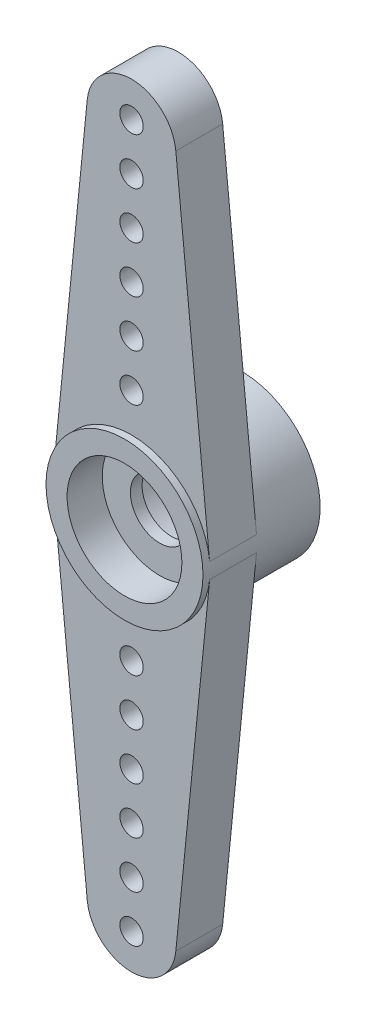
from build123d import *
from build123d.topology import SkipClean

# Parameters (mm, degrees)
EXTRUDE_1_DEPTH     = 2
SKETCH_2_R          = 3.35
EXTRUDE_2_DEPTH     = 0.3
EXTRUDE_START       = 2.7
SKETCH_3_R          = 3.35
EXTRUDE_3_DEPTH     = 2.7
SKETCH_4_R          = 2.45
CUT_EXTRUDE_1_DEPTH = 1.5
SKETCH_5_R          = 1.25
CUT_EXTRUDE_2_DEPTH = 18.196583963
CUT_EXTRUDE_START   = -3
SKETCH_6_R          = 2.45
CUT_EXTRUDE_3_DEPTH = 3
SKETCH_7_R          = 0.5
CUT_EXTRUDE_4_DEPTH = 18.480346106


with BuildPart() as part:
    # Sketch 1 → Extrude 1 (new body)
    with BuildSketch(Plane.XY):
        with BuildLine():
            Line((-3.333437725, 0.332705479), (-1.890606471, 14.78869863))
            ThreePointArc((-1.890606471, 14.78869863), (0, 16.5), (1.890606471, 14.78869863))
            Line((1.890606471, 14.78869863), (3.333437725, 0.332705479))
            ThreePointArc((3.333437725, 0.332705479), (3.35, 0), (3.333437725, -0.332705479))
            Line((3.333437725, -0.332705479), (1.890606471, -14.78869863))
            ThreePointArc((1.890606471, -14.78869863), (0, -16.5), (-1.890606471, -14.78869863))
            Line((-1.890606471, -14.78869863), (-3.333437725, -0.332705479))
            ThreePointArc((-3.333437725, -0.332705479), (-3.35, 0), (-3.333437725, 0.332705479))
        make_face()
    extrude(amount=EXTRUDE_1_DEPTH)

    # Sketch 2 → Extrude 2 (add)
    with SkipClean():  # the faces are left unmerged after this step: merging them gives an invalid solid
        with BuildSketch(Plane.XY.offset(2)):
            with Locations(Location((0, 0, 0), (0, 0, 185.699730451))):
                Circle(SKETCH_2_R)
        extrude(amount=EXTRUDE_2_DEPTH)

    # Sketch 3 → Extrude 3 (add)
    with BuildSketch(Plane(origin=(0, 0, 0), x_dir=(-1, 0, 0), z_dir=(0, 0, -1)).offset(EXTRUDE_START)):
        Circle(SKETCH_3_R)
    extrude(amount=-EXTRUDE_3_DEPTH)

    # Sketch 4 → Cut-Extrude 1 (cut)
    with BuildSketch(Plane.XY.offset(2.3)):
        Circle(SKETCH_4_R)
    extrude(amount=-CUT_EXTRUDE_1_DEPTH, mode=Mode.SUBTRACT)

    # Sketch 5 → Cut-Extrude 2 (cut, through all)
    with BuildSketch(Plane.XY.offset(0.8)):
        Circle(SKETCH_5_R)
    extrude(amount=-CUT_EXTRUDE_2_DEPTH, mode=Mode.SUBTRACT)

    # Sketch 6 → Cut-Extrude 3 (cut)
    with BuildSketch(Plane(origin=(0, 0, -2.7), x_dir=(-1, 0, 0), z_dir=(0, 0, -1)).offset(CUT_EXTRUDE_START)):
        with Locations(Location((0, 0, 0), (0, 0, 180))):
            Circle(SKETCH_6_R)
    extrude(amount=CUT_EXTRUDE_3_DEPTH, mode=Mode.SUBTRACT)

    # Sketch 7 → Cut-Extrude 4 (cut, through all)
    with BuildSketch(Plane.XY.offset(2)):
        with Locations((0, 15)):
            Circle(SKETCH_7_R)
        with Locations((0, -15)):
            Circle(SKETCH_7_R)
        with Locations((0, -5)):
            Circle(SKETCH_7_R)
        with Locations((0, 5)):
            Circle(SKETCH_7_R)
        with Locations((0, -7)):
            Circle(SKETCH_7_R)
        with Locations((0, 7)):
            Circle(SKETCH_7_R)
        with Locations((0, -9)):
            Circle(SKETCH_7_R)
        with Locations((0, -11)):
            Circle(SKETCH_7_R)
        with Locations((0, 9)):
            Circle(SKETCH_7_R)
        with Locations((0, 11)):
            Circle(SKETCH_7_R)
        with Locations((0, 13)):
            Circle(SKETCH_7_R)
        with Locations((0, -13)):
            Circle(SKETCH_7_R)
    extrude(amount=-CUT_EXTRUDE_4_DEPTH, mode=Mode.SUBTRACT)


solid = part.part
